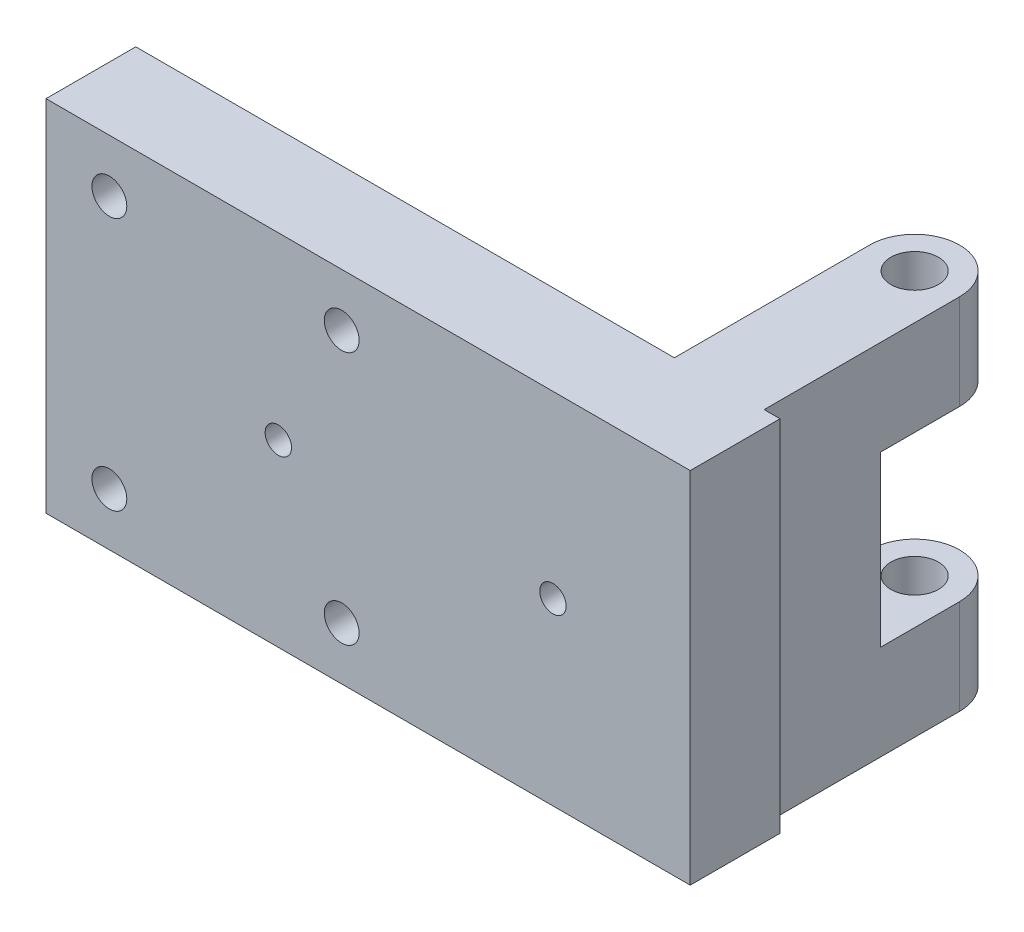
from build123d import *

# Parameters (mm, degrees)
ESQUISSE1_W       = 122
ESQUISSE1_H       = 68
EXTRUSION1_DEPTH  = 17
D_GAGEMENT_M61_D  = 6.6
TROU_TARAUD_M61_D = 5
ESQUISSE6_R       = 4.5
EXTRUSION2_DEPTH  = 18
ESQUISSE7_W       = 22
ESQUISSE7_H       = 32
EXTRUSION3_DEPTH  = 17


with BuildPart() as part:
    # Esquisse1 → Extrusion1 (new body)
    with BuildSketch(Plane.XY):
        with Locations((61, 34)):
            Rectangle(ESQUISSE1_W, ESQUISSE1_H)
    extrude(amount=EXTRUSION1_DEPTH)

    # D_gagement M61 (through all)
    with Locations(Plane.XY.offset(17)):
        with Locations((12, 58), (56, 58), (56, 10), (12, 10)):
            Hole(D_GAGEMENT_M61_D / 2)

    # Trou taraud_ M61 (through all)
    with Locations(Plane.XY.offset(17)):
        with Locations((44, 34), (96, 34)):
            Hole(TROU_TARAUD_M61_D / 2)

    # Esquisse6 → Extrusion2 (add)
    with BuildSketch(Plane.XZ):
        with BuildLine():
            Line((119, 0), (119, -37))
            ThreePointArc((119, -37), (110.5, -45.5), (102, -37))
            Line((102, -37), (102, 0))
            Line((102, 0), (119, 0))
        make_face()
        with Locations(Location((110.5, -37, 0), (0, 0, 270))):
            Circle(ESQUISSE6_R, mode=Mode.SUBTRACT)
    extrusion2 = extrude(amount=-EXTRUSION2_DEPTH)

    # Sym_trie1: Extrusion2 across plane
    add(extrusion2.mirror(Plane(origin=(0, 34, 0), x_dir=(0, 0, 1), z_dir=(0, -1, 0))))

    # Esquisse7 → Extrusion3 (add)
    with BuildSketch(Plane(origin=(119, 0, 0), x_dir=(0, 0, -1), z_dir=(1, 0, 0))):
        with Locations((11, 34)):
            Rectangle(ESQUISSE7_W, ESQUISSE7_H)
    extrude(amount=-EXTRUSION3_DEPTH)


solid = part.part
